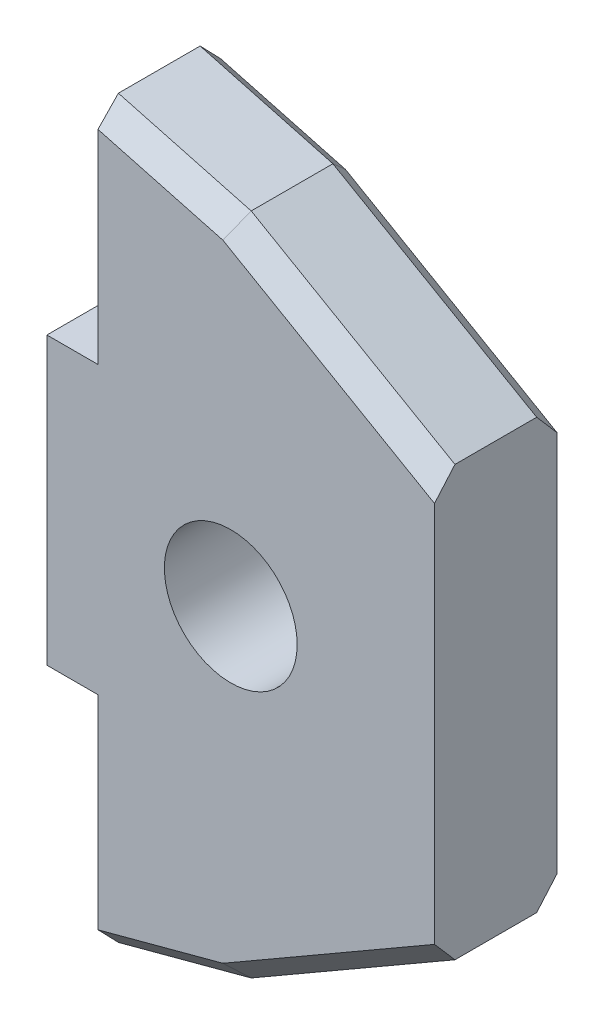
ISO-10303-21;
HEADER;
FILE_DESCRIPTION(('STEP AP214'),'2;1');
FILE_NAME('part.step','',(''),(''),'','','');
FILE_SCHEMA(('AUTOMOTIVE_DESIGN { 1 0 10303 214 1 1 1 1 }'));
ENDSEC;
DATA;
#1=APPLICATION_CONTEXT('core data for automotive mechanical design processes');
#2=APPLICATION_PROTOCOL_DEFINITION('international standard','automotive_design',2000,#1);
#3=PRODUCT_CONTEXT('',#1,'mechanical');
#4=PRODUCT('Part','Part','',(#3));
#5=PRODUCT_RELATED_PRODUCT_CATEGORY('part','',(#4));
#6=PRODUCT_DEFINITION_FORMATION('','',#4);
#7=PRODUCT_DEFINITION_CONTEXT('part definition',#1,'design');
#8=PRODUCT_DEFINITION('design','',#6,#7);
#9=PRODUCT_DEFINITION_SHAPE('','',#8);
#10=(LENGTH_UNIT() NAMED_UNIT(*) SI_UNIT(.MILLI.,.METRE.));
#11=(NAMED_UNIT(*) PLANE_ANGLE_UNIT() SI_UNIT($,.RADIAN.));
#12=(NAMED_UNIT(*) SI_UNIT($,.STERADIAN.) SOLID_ANGLE_UNIT());
#13=UNCERTAINTY_MEASURE_WITH_UNIT(LENGTH_MEASURE(1.E-05),#10,'distance_accuracy_value','');
#14=(GEOMETRIC_REPRESENTATION_CONTEXT(3) GLOBAL_UNCERTAINTY_ASSIGNED_CONTEXT((#13)) GLOBAL_UNIT_ASSIGNED_CONTEXT((#10,
#11,#12)) REPRESENTATION_CONTEXT('',''));
#15=CARTESIAN_POINT('',(0.,0.,0.));
#16=DIRECTION('',(0.,0.,1.));
#17=DIRECTION('',(1.,0.,0.));
#18=AXIS2_PLACEMENT_3D('',#15,#16,#17);
#19=CARTESIAN_POINT('',(0.,0.,12.));
#20=DIRECTION('',(0.,0.,-1.));
#21=DIRECTION('',(-1.,0.,0.));
#22=AXIS2_PLACEMENT_3D('',#19,#20,#21);
#23=PLANE('',#22);
#24=DIRECTION('',(0.,-1.,0.));
#25=VECTOR('',#24,1.);
#26=CARTESIAN_POINT('',(-13.,-14.,12.));
#27=LINE('',#26,#25);
#28=CARTESIAN_POINT('',(-13.,-14.,12.));
#29=VERTEX_POINT('',#28);
#30=CARTESIAN_POINT('',(-13.,-33.9294476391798,12.));
#31=VERTEX_POINT('',#30);
#32=EDGE_CURVE('E192',#29,#31,#27,.T.);
#33=ORIENTED_EDGE('',*,*,#32,.T.);
#34=DIRECTION('',(0.965925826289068,0.258819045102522,0.));
#35=VECTOR('',#34,1.);
#36=CARTESIAN_POINT('',(7.61152703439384,-28.4066056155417,12.));
#37=LINE('',#36,#35);
#38=CARTESIAN_POINT('',(-0.771971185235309,-30.6529571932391,12.));
#39=VERTEX_POINT('',#38);
#40=EDGE_CURVE('E262',#31,#39,#37,.T.);
#41=ORIENTED_EDGE('',*,*,#40,.T.);
#42=DIRECTION('',(0.866025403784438,0.5,0.));
#43=VECTOR('',#42,1.);
#44=CARTESIAN_POINT('',(13.0801270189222,-22.6554445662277,12.));
#45=LINE('',#44,#43);
#46=CARTESIAN_POINT('',(19.9474411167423,-18.6905989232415,12.));
#47=VERTEX_POINT('',#46);
#48=EDGE_CURVE('E265',#39,#47,#45,.T.);
#49=ORIENTED_EDGE('',*,*,#48,.T.);
#50=DIRECTION('',(0.,1.,0.));
#51=VECTOR('',#50,1.);
#52=CARTESIAN_POINT('',(19.9474411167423,21.,12.));
#53=LINE('',#52,#51);
#54=CARTESIAN_POINT('',(19.9474411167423,18.6905989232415,12.));
#55=VERTEX_POINT('',#54);
#56=EDGE_CURVE('E193',#47,#55,#53,.T.);
#57=ORIENTED_EDGE('',*,*,#56,.T.);
#58=DIRECTION('',(-0.866025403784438,0.5,0.));
#59=VECTOR('',#58,1.);
#60=CARTESIAN_POINT('',(13.0801270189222,22.6554445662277,12.));
#61=LINE('',#60,#59);
#62=CARTESIAN_POINT('',(-0.771971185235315,30.6529571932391,12.));
#63=VERTEX_POINT('',#62);
#64=EDGE_CURVE('E257',#55,#63,#61,.T.);
#65=ORIENTED_EDGE('',*,*,#64,.T.);
#66=DIRECTION('',(-0.965925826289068,0.258819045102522,0.));
#67=VECTOR('',#66,1.);
#68=CARTESIAN_POINT('',(7.61152703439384,28.4066056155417,12.));
#69=LINE('',#68,#67);
#70=CARTESIAN_POINT('',(-13.,33.9294476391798,12.));
#71=VERTEX_POINT('',#70);
#72=EDGE_CURVE('E164',#63,#71,#69,.T.);
#73=ORIENTED_EDGE('',*,*,#72,.T.);
#74=DIRECTION('',(0.,-1.,0.));
#75=VECTOR('',#74,1.);
#76=CARTESIAN_POINT('',(-13.,14.,12.));
#77=LINE('',#76,#75);
#78=CARTESIAN_POINT('',(-13.,14.,12.));
#79=VERTEX_POINT('',#78);
#80=EDGE_CURVE('E156',#71,#79,#77,.T.);
#81=ORIENTED_EDGE('',*,*,#80,.T.);
#82=DIRECTION('',(-1.,0.,0.));
#83=VECTOR('',#82,1.);
#84=CARTESIAN_POINT('',(-18.,14.,12.));
#85=LINE('',#84,#83);
#86=CARTESIAN_POINT('',(-18.,14.,12.));
#87=VERTEX_POINT('',#86);
#88=EDGE_CURVE('E161',#79,#87,#85,.T.);
#89=ORIENTED_EDGE('',*,*,#88,.T.);
#90=DIRECTION('',(0.,-1.,0.));
#91=VECTOR('',#90,1.);
#92=CARTESIAN_POINT('',(-18.,-14.,12.));
#93=LINE('',#92,#91);
#94=CARTESIAN_POINT('',(-18.,-14.,12.));
#95=VERTEX_POINT('',#94);
#96=EDGE_CURVE('E184',#87,#95,#93,.T.);
#97=ORIENTED_EDGE('',*,*,#96,.T.);
#98=DIRECTION('',(1.,0.,0.));
#99=VECTOR('',#98,1.);
#100=CARTESIAN_POINT('',(-18.,-14.,12.));
#101=LINE('',#100,#99);
#102=EDGE_CURVE('E187',#95,#29,#101,.T.);
#103=ORIENTED_EDGE('',*,*,#102,.T.);
#104=EDGE_LOOP('',(#33,#41,#49,#57,#65,#73,#81,#89,#97,#103));
#105=FACE_BOUND('',#104,.T.);
#106=CARTESIAN_POINT('',(0.,0.,12.));
#107=DIRECTION('',(0.,0.,1.));
#108=DIRECTION('',(1.,0.,0.));
#109=AXIS2_PLACEMENT_3D('',#106,#107,#108);
#110=CIRCLE('',#109,6.5);
#111=CARTESIAN_POINT('',(6.5,0.,12.));
#112=VERTEX_POINT('',#111);
#113=EDGE_CURVE('E200',#112,#112,#110,.T.);
#114=ORIENTED_EDGE('',*,*,#113,.F.);
#115=EDGE_LOOP('',(#114));
#116=FACE_BOUND('',#115,.T.);
#117=ADVANCED_FACE('F41',(#105,#116),#23,.F.);
#118=CARTESIAN_POINT('',(0.,0.,0.));
#119=DIRECTION('',(0.,0.,-1.));
#120=DIRECTION('',(-1.,0.,0.));
#121=AXIS2_PLACEMENT_3D('',#118,#119,#120);
#122=PLANE('',#121);
#123=DIRECTION('',(-0.866025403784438,-0.5,0.));
#124=VECTOR('',#123,1.);
#125=CARTESIAN_POINT('',(-1.00000000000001,-30.7846096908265,0.));
#126=LINE('',#125,#124);
#127=CARTESIAN_POINT('',(19.9474411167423,-18.6905989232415,0.));
#128=VERTEX_POINT('',#127);
#129=CARTESIAN_POINT('',(-0.771971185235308,-30.6529571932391,0.));
#130=VERTEX_POINT('',#129);
#131=EDGE_CURVE('E239',#128,#130,#126,.T.);
#132=ORIENTED_EDGE('',*,*,#131,.T.);
#133=DIRECTION('',(-0.965925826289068,-0.258819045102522,0.));
#134=VECTOR('',#133,1.);
#135=CARTESIAN_POINT('',(-13.517638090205,-34.0681483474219,0.));
#136=LINE('',#135,#134);
#137=CARTESIAN_POINT('',(-13.,-33.9294476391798,0.));
#138=VERTEX_POINT('',#137);
#139=EDGE_CURVE('E242',#130,#138,#136,.T.);
#140=ORIENTED_EDGE('',*,*,#139,.T.);
#141=DIRECTION('',(0.,-1.,0.));
#142=VECTOR('',#141,1.);
#143=CARTESIAN_POINT('',(-13.,-14.,0.));
#144=LINE('',#143,#142);
#145=CARTESIAN_POINT('',(-13.,-14.,0.));
#146=VERTEX_POINT('',#145);
#147=EDGE_CURVE('E202',#146,#138,#144,.T.);
#148=ORIENTED_EDGE('',*,*,#147,.F.);
#149=DIRECTION('',(1.,0.,0.));
#150=VECTOR('',#149,1.);
#151=CARTESIAN_POINT('',(-18.,-14.,0.));
#152=LINE('',#151,#150);
#153=CARTESIAN_POINT('',(-18.,-14.,0.));
#154=VERTEX_POINT('',#153);
#155=EDGE_CURVE('E201',#154,#146,#152,.T.);
#156=ORIENTED_EDGE('',*,*,#155,.F.);
#157=DIRECTION('',(0.,-1.,0.));
#158=VECTOR('',#157,1.);
#159=CARTESIAN_POINT('',(-18.,-14.,0.));
#160=LINE('',#159,#158);
#161=CARTESIAN_POINT('',(-18.,14.,0.));
#162=VERTEX_POINT('',#161);
#163=EDGE_CURVE('E203',#162,#154,#160,.T.);
#164=ORIENTED_EDGE('',*,*,#163,.F.);
#165=DIRECTION('',(-1.,0.,0.));
#166=VECTOR('',#165,1.);
#167=CARTESIAN_POINT('',(-18.,14.,0.));
#168=LINE('',#167,#166);
#169=CARTESIAN_POINT('',(-13.,14.,0.));
#170=VERTEX_POINT('',#169);
#171=EDGE_CURVE('E196',#170,#162,#168,.T.);
#172=ORIENTED_EDGE('',*,*,#171,.F.);
#173=DIRECTION('',(0.,-1.,0.));
#174=VECTOR('',#173,1.);
#175=CARTESIAN_POINT('',(-13.,14.,0.));
#176=LINE('',#175,#174);
#177=CARTESIAN_POINT('',(-13.,33.9294476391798,0.));
#178=VERTEX_POINT('',#177);
#179=EDGE_CURVE('E173',#178,#170,#176,.T.);
#180=ORIENTED_EDGE('',*,*,#179,.F.);
#181=DIRECTION('',(0.965925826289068,-0.258819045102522,0.));
#182=VECTOR('',#181,1.);
#183=CARTESIAN_POINT('',(-0.51763809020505,30.5848088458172,0.));
#184=LINE('',#183,#182);
#185=CARTESIAN_POINT('',(-0.7719711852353,30.6529571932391,0.));
#186=VERTEX_POINT('',#185);
#187=EDGE_CURVE('E240',#178,#186,#184,.T.);
#188=ORIENTED_EDGE('',*,*,#187,.T.);
#189=DIRECTION('',(0.866025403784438,-0.5,0.));
#190=VECTOR('',#189,1.);
#191=CARTESIAN_POINT('',(18.9474411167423,19.2679491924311,0.));
#192=LINE('',#191,#190);
#193=CARTESIAN_POINT('',(19.9474411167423,18.6905989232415,0.));
#194=VERTEX_POINT('',#193);
#195=EDGE_CURVE('E231',#186,#194,#192,.T.);
#196=ORIENTED_EDGE('',*,*,#195,.T.);
#197=DIRECTION('',(0.,1.,0.));
#198=VECTOR('',#197,1.);
#199=CARTESIAN_POINT('',(19.9474411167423,21.,0.));
#200=LINE('',#199,#198);
#201=EDGE_CURVE('E169',#128,#194,#200,.T.);
#202=ORIENTED_EDGE('',*,*,#201,.F.);
#203=EDGE_LOOP('',(#132,#140,#148,#156,#164,#172,#180,#188,#196,#202));
#204=FACE_BOUND('',#203,.T.);
#205=CARTESIAN_POINT('',(0.,0.,0.));
#206=DIRECTION('',(0.,0.,1.));
#207=DIRECTION('',(1.,0.,0.));
#208=AXIS2_PLACEMENT_3D('',#205,#206,#207);
#209=CIRCLE('',#208,6.5);
#210=CARTESIAN_POINT('',(6.5,0.,0.));
#211=VERTEX_POINT('',#210);
#212=EDGE_CURVE('E279',#211,#211,#209,.T.);
#213=ORIENTED_EDGE('',*,*,#212,.T.);
#214=EDGE_LOOP('',(#213));
#215=FACE_BOUND('',#214,.T.);
#216=ADVANCED_FACE('F327',(#204,#215),#122,.T.);
#217=CARTESIAN_POINT('',(0.,32.5166604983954,12.));
#218=DIRECTION('',(-0.5,-0.866025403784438,0.));
#219=DIRECTION('',(0.866025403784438,-0.5,0.));
#220=AXIS2_PLACEMENT_3D('',#217,#218,#219);
#221=PLANE('',#220);
#222=DIRECTION('',(0.,0.,-1.));
#223=VECTOR('',#222,1.);
#224=CARTESIAN_POINT('',(19.9474411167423,21.,12.));
#225=LINE('',#224,#223);
#226=CARTESIAN_POINT('',(19.9474411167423,21.,10.));
#227=VERTEX_POINT('',#226);
#228=CARTESIAN_POINT('',(19.9474411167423,21.,2.));
#229=VERTEX_POINT('',#228);
#230=EDGE_CURVE('E198',#227,#229,#225,.T.);
#231=ORIENTED_EDGE('',*,*,#230,.T.);
#232=DIRECTION('',(-0.866025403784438,0.5,0.));
#233=VECTOR('',#232,1.);
#234=CARTESIAN_POINT('',(0.,32.5166604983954,2.));
#235=LINE('',#234,#233);
#236=CARTESIAN_POINT('',(0.,32.5166604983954,2.));
#237=VERTEX_POINT('',#236);
#238=EDGE_CURVE('E11',#229,#237,#235,.T.);
#239=ORIENTED_EDGE('',*,*,#238,.T.);
#240=DIRECTION('',(0.,0.,-1.));
#241=VECTOR('',#240,1.);
#242=CARTESIAN_POINT('',(0.,32.5166604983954,12.));
#243=LINE('',#242,#241);
#244=CARTESIAN_POINT('',(0.,32.5166604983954,10.));
#245=VERTEX_POINT('',#244);
#246=EDGE_CURVE('E229',#245,#237,#243,.T.);
#247=ORIENTED_EDGE('',*,*,#246,.F.);
#248=DIRECTION('',(0.866025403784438,-0.5,0.));
#249=VECTOR('',#248,1.);
#250=CARTESIAN_POINT('',(0.,32.5166604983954,10.));
#251=LINE('',#250,#249);
#252=EDGE_CURVE('E51',#245,#227,#251,.T.);
#253=ORIENTED_EDGE('',*,*,#252,.T.);
#254=EDGE_LOOP('',(#231,#239,#247,#253));
#255=FACE_BOUND('',#254,.T.);
#256=ADVANCED_FACE('F341',(#255),#221,.F.);
#257=CARTESIAN_POINT('',(-13.,36.,12.));
#258=DIRECTION('',(-0.258819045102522,-0.965925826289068,0.));
#259=DIRECTION('',(0.965925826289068,-0.258819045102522,0.));
#260=AXIS2_PLACEMENT_3D('',#257,#258,#259);
#261=PLANE('',#260);
#262=ORIENTED_EDGE('',*,*,#246,.T.);
#263=DIRECTION('',(-0.965925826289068,0.258819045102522,0.));
#264=VECTOR('',#263,1.);
#265=CARTESIAN_POINT('',(-13.,36.,2.));
#266=LINE('',#265,#264);
#267=CARTESIAN_POINT('',(-13.,36.,2.));
#268=VERTEX_POINT('',#267);
#269=EDGE_CURVE('E268',#237,#268,#266,.T.);
#270=ORIENTED_EDGE('',*,*,#269,.T.);
#271=DIRECTION('',(0.,0.,-1.));
#272=VECTOR('',#271,1.);
#273=CARTESIAN_POINT('',(-13.,36.,12.));
#274=LINE('',#273,#272);
#275=CARTESIAN_POINT('',(-13.,36.,10.));
#276=VERTEX_POINT('',#275);
#277=EDGE_CURVE('E178',#276,#268,#274,.T.);
#278=ORIENTED_EDGE('',*,*,#277,.F.);
#279=DIRECTION('',(0.965925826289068,-0.258819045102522,0.));
#280=VECTOR('',#279,1.);
#281=CARTESIAN_POINT('',(-13.,36.,10.));
#282=LINE('',#281,#280);
#283=EDGE_CURVE('E61',#276,#245,#282,.T.);
#284=ORIENTED_EDGE('',*,*,#283,.T.);
#285=EDGE_LOOP('',(#262,#270,#278,#284));
#286=FACE_BOUND('',#285,.T.);
#287=ADVANCED_FACE('F347',(#286),#261,.F.);
#288=CARTESIAN_POINT('',(-13.,14.,12.));
#289=DIRECTION('',(1.,0.,0.));
#290=DIRECTION('',(0.,0.,-1.));
#291=AXIS2_PLACEMENT_3D('',#288,#289,#290);
#292=PLANE('',#291);
#293=ORIENTED_EDGE('',*,*,#277,.T.);
#294=DIRECTION('',(0.,-0.719254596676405,-0.694746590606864));
#295=VECTOR('',#294,1.);
#296=CARTESIAN_POINT('',(-13.,36.,2.));
#297=LINE('',#296,#295);
#298=EDGE_CURVE('E272',#268,#178,#297,.T.);
#299=ORIENTED_EDGE('',*,*,#298,.T.);
#300=ORIENTED_EDGE('',*,*,#179,.T.);
#301=DIRECTION('',(0.,0.,-1.));
#302=VECTOR('',#301,1.);
#303=CARTESIAN_POINT('',(-13.,14.,12.));
#304=LINE('',#303,#302);
#305=EDGE_CURVE('E172',#79,#170,#304,.T.);
#306=ORIENTED_EDGE('',*,*,#305,.F.);
#307=ORIENTED_EDGE('',*,*,#80,.F.);
#308=DIRECTION('',(0.,-0.719254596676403,0.694746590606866));
#309=VECTOR('',#308,1.);
#310=CARTESIAN_POINT('',(-13.,31.0723313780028,14.7597623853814));
#311=LINE('',#310,#309);
#312=EDGE_CURVE('E271',#71,#276,#311,.F.);
#313=ORIENTED_EDGE('',*,*,#312,.T.);
#314=EDGE_LOOP('',(#293,#299,#300,#306,#307,#313));
#315=FACE_BOUND('',#314,.T.);
#316=ADVANCED_FACE('F174',(#315),#292,.F.);
#317=CARTESIAN_POINT('',(-18.,14.,12.));
#318=DIRECTION('',(0.,-1.,0.));
#319=DIRECTION('',(0.,0.,-1.));
#320=AXIS2_PLACEMENT_3D('',#317,#318,#319);
#321=PLANE('',#320);
#322=ORIENTED_EDGE('',*,*,#171,.T.);
#323=DIRECTION('',(0.,0.,-1.));
#324=VECTOR('',#323,1.);
#325=CARTESIAN_POINT('',(-18.,14.,12.));
#326=LINE('',#325,#324);
#327=EDGE_CURVE('E179',#87,#162,#326,.T.);
#328=ORIENTED_EDGE('',*,*,#327,.F.);
#329=ORIENTED_EDGE('',*,*,#88,.F.);
#330=ORIENTED_EDGE('',*,*,#305,.T.);
#331=EDGE_LOOP('',(#322,#328,#329,#330));
#332=FACE_BOUND('',#331,.T.);
#333=ADVANCED_FACE('F182',(#332),#321,.F.);
#334=CARTESIAN_POINT('',(-18.,-14.,12.));
#335=DIRECTION('',(1.,0.,0.));
#336=DIRECTION('',(0.,0.,-1.));
#337=AXIS2_PLACEMENT_3D('',#334,#335,#336);
#338=PLANE('',#337);
#339=ORIENTED_EDGE('',*,*,#163,.T.);
#340=DIRECTION('',(0.,0.,-1.));
#341=VECTOR('',#340,1.);
#342=CARTESIAN_POINT('',(-18.,-14.,12.));
#343=LINE('',#342,#341);
#344=EDGE_CURVE('E224',#95,#154,#343,.T.);
#345=ORIENTED_EDGE('',*,*,#344,.F.);
#346=ORIENTED_EDGE('',*,*,#96,.F.);
#347=ORIENTED_EDGE('',*,*,#327,.T.);
#348=EDGE_LOOP('',(#339,#345,#346,#347));
#349=FACE_BOUND('',#348,.T.);
#350=ADVANCED_FACE('F380',(#349),#338,.F.);
#351=CARTESIAN_POINT('',(-18.,-14.,12.));
#352=DIRECTION('',(0.,1.,0.));
#353=DIRECTION('',(0.,0.,1.));
#354=AXIS2_PLACEMENT_3D('',#351,#352,#353);
#355=PLANE('',#354);
#356=ORIENTED_EDGE('',*,*,#155,.T.);
#357=DIRECTION('',(0.,0.,-1.));
#358=VECTOR('',#357,1.);
#359=CARTESIAN_POINT('',(-13.,-14.,12.));
#360=LINE('',#359,#358);
#361=EDGE_CURVE('E219',#29,#146,#360,.T.);
#362=ORIENTED_EDGE('',*,*,#361,.F.);
#363=ORIENTED_EDGE('',*,*,#102,.F.);
#364=ORIENTED_EDGE('',*,*,#344,.T.);
#365=EDGE_LOOP('',(#356,#362,#363,#364));
#366=FACE_BOUND('',#365,.T.);
#367=ADVANCED_FACE('F323',(#366),#355,.F.);
#368=CARTESIAN_POINT('',(-13.,-14.,12.));
#369=DIRECTION('',(1.,0.,0.));
#370=DIRECTION('',(0.,0.,-1.));
#371=AXIS2_PLACEMENT_3D('',#368,#369,#370);
#372=PLANE('',#371);
#373=ORIENTED_EDGE('',*,*,#147,.T.);
#374=DIRECTION('',(0.,-0.719254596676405,0.694746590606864));
#375=VECTOR('',#374,1.);
#376=CARTESIAN_POINT('',(-13.,-36.,2.));
#377=LINE('',#376,#375);
#378=CARTESIAN_POINT('',(-13.,-36.,2.));
#379=VERTEX_POINT('',#378);
#380=EDGE_CURVE('E243',#138,#379,#377,.T.);
#381=ORIENTED_EDGE('',*,*,#380,.T.);
#382=DIRECTION('',(0.,0.,-1.));
#383=VECTOR('',#382,1.);
#384=CARTESIAN_POINT('',(-13.,-36.,12.));
#385=LINE('',#384,#383);
#386=CARTESIAN_POINT('',(-13.,-36.,9.99999999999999));
#387=VERTEX_POINT('',#386);
#388=EDGE_CURVE('E220',#387,#379,#385,.T.);
#389=ORIENTED_EDGE('',*,*,#388,.F.);
#390=DIRECTION('',(0.,-0.719254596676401,-0.694746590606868));
#391=VECTOR('',#390,1.);
#392=CARTESIAN_POINT('',(-13.,-31.0723313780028,14.7597623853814));
#393=LINE('',#392,#391);
#394=EDGE_CURVE('E244',#387,#31,#393,.F.);
#395=ORIENTED_EDGE('',*,*,#394,.T.);
#396=ORIENTED_EDGE('',*,*,#32,.F.);
#397=ORIENTED_EDGE('',*,*,#361,.T.);
#398=EDGE_LOOP('',(#373,#381,#389,#395,#396,#397));
#399=FACE_BOUND('',#398,.T.);
#400=ADVANCED_FACE('F318',(#399),#372,.F.);
#401=CARTESIAN_POINT('',(-13.,-36.,12.));
#402=DIRECTION('',(-0.258819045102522,0.965925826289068,0.));
#403=DIRECTION('',(-0.965925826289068,-0.258819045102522,0.));
#404=AXIS2_PLACEMENT_3D('',#401,#402,#403);
#405=PLANE('',#404);
#406=ORIENTED_EDGE('',*,*,#388,.T.);
#407=DIRECTION('',(0.965925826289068,0.258819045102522,0.));
#408=VECTOR('',#407,1.);
#409=CARTESIAN_POINT('',(0.,-32.5166604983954,2.));
#410=LINE('',#409,#408);
#411=CARTESIAN_POINT('',(0.,-32.5166604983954,2.));
#412=VERTEX_POINT('',#411);
#413=EDGE_CURVE('E235',#379,#412,#410,.T.);
#414=ORIENTED_EDGE('',*,*,#413,.T.);
#415=DIRECTION('',(0.,0.,-1.));
#416=VECTOR('',#415,1.);
#417=CARTESIAN_POINT('',(0.,-32.5166604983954,12.));
#418=LINE('',#417,#416);
#419=CARTESIAN_POINT('',(0.,-32.5166604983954,9.99999999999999));
#420=VERTEX_POINT('',#419);
#421=EDGE_CURVE('E212',#420,#412,#418,.T.);
#422=ORIENTED_EDGE('',*,*,#421,.F.);
#423=DIRECTION('',(-0.965925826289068,-0.258819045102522,0.));
#424=VECTOR('',#423,1.);
#425=CARTESIAN_POINT('',(-13.,-36.,9.99999999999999));
#426=LINE('',#425,#424);
#427=EDGE_CURVE('E228',#420,#387,#426,.T.);
#428=ORIENTED_EDGE('',*,*,#427,.T.);
#429=EDGE_LOOP('',(#406,#414,#422,#428));
#430=FACE_BOUND('',#429,.T.);
#431=ADVANCED_FACE('F310',(#430),#405,.F.);
#432=CARTESIAN_POINT('',(0.,-32.5166604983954,12.));
#433=DIRECTION('',(-0.5,0.866025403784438,0.));
#434=DIRECTION('',(-0.866025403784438,-0.5,0.));
#435=AXIS2_PLACEMENT_3D('',#432,#433,#434);
#436=PLANE('',#435);
#437=ORIENTED_EDGE('',*,*,#421,.T.);
#438=DIRECTION('',(0.866025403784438,0.5,0.));
#439=VECTOR('',#438,1.);
#440=CARTESIAN_POINT('',(19.9474411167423,-21.,2.));
#441=LINE('',#440,#439);
#442=CARTESIAN_POINT('',(19.9474411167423,-21.,2.));
#443=VERTEX_POINT('',#442);
#444=EDGE_CURVE('E249',#412,#443,#441,.T.);
#445=ORIENTED_EDGE('',*,*,#444,.T.);
#446=DIRECTION('',(0.,0.,-1.));
#447=VECTOR('',#446,1.);
#448=CARTESIAN_POINT('',(19.9474411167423,-21.,12.));
#449=LINE('',#448,#447);
#450=CARTESIAN_POINT('',(19.9474411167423,-21.,9.99999999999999));
#451=VERTEX_POINT('',#450);
#452=EDGE_CURVE('E211',#451,#443,#449,.T.);
#453=ORIENTED_EDGE('',*,*,#452,.F.);
#454=DIRECTION('',(-0.866025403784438,-0.5,0.));
#455=VECTOR('',#454,1.);
#456=CARTESIAN_POINT('',(0.,-32.5166604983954,9.99999999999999));
#457=LINE('',#456,#455);
#458=EDGE_CURVE('E250',#451,#420,#457,.T.);
#459=ORIENTED_EDGE('',*,*,#458,.T.);
#460=EDGE_LOOP('',(#437,#445,#453,#459));
#461=FACE_BOUND('',#460,.T.);
#462=ADVANCED_FACE('F308',(#461),#436,.F.);
#463=CARTESIAN_POINT('',(19.9474411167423,21.,12.));
#464=DIRECTION('',(-1.,0.,0.));
#465=DIRECTION('',(0.,0.,1.));
#466=AXIS2_PLACEMENT_3D('',#463,#464,#465);
#467=PLANE('',#466);
#468=ORIENTED_EDGE('',*,*,#452,.T.);
#469=DIRECTION('',(0.,0.755928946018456,-0.654653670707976));
#470=VECTOR('',#469,1.);
#471=CARTESIAN_POINT('',(19.9474411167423,-27.580948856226,7.6992688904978));
#472=LINE('',#471,#470);
#473=EDGE_CURVE('E260',#443,#128,#472,.T.);
#474=ORIENTED_EDGE('',*,*,#473,.T.);
#475=ORIENTED_EDGE('',*,*,#201,.T.);
#476=DIRECTION('',(0.,0.755928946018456,0.654653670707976));
#477=VECTOR('',#476,1.);
#478=CARTESIAN_POINT('',(19.9474411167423,27.580948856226,7.6992688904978));
#479=LINE('',#478,#477);
#480=EDGE_CURVE('E251',#194,#229,#479,.T.);
#481=ORIENTED_EDGE('',*,*,#480,.T.);
#482=ORIENTED_EDGE('',*,*,#230,.F.);
#483=DIRECTION('',(0.,0.755928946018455,-0.654653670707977));
#484=VECTOR('',#483,1.);
#485=CARTESIAN_POINT('',(19.9474411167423,20.9562250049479,10.0379102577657));
#486=LINE('',#485,#484);
#487=EDGE_CURVE('E253',#227,#55,#486,.F.);
#488=ORIENTED_EDGE('',*,*,#487,.T.);
#489=ORIENTED_EDGE('',*,*,#56,.F.);
#490=DIRECTION('',(0.,0.755928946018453,0.654653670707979));
#491=VECTOR('',#490,1.);
#492=CARTESIAN_POINT('',(19.9474411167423,-20.9562250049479,10.0379102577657));
#493=LINE('',#492,#491);
#494=EDGE_CURVE('E254',#47,#451,#493,.F.);
#495=ORIENTED_EDGE('',*,*,#494,.T.);
#496=EDGE_LOOP('',(#468,#474,#475,#481,#482,#488,#489,#495));
#497=FACE_BOUND('',#496,.T.);
#498=ADVANCED_FACE('F300',(#497),#467,.F.);
#499=CARTESIAN_POINT('',(0.,0.,12.));
#500=DIRECTION('',(0.,0.,-1.));
#501=DIRECTION('',(-1.,0.,0.));
#502=AXIS2_PLACEMENT_3D('',#499,#500,#501);
#503=CYLINDRICAL_SURFACE('',#502,6.5);
#504=ORIENTED_EDGE('',*,*,#113,.T.);
#505=EDGE_LOOP('',(#504));
#506=FACE_BOUND('',#505,.T.);
#507=ORIENTED_EDGE('',*,*,#212,.F.);
#508=EDGE_LOOP('',(#507));
#509=FACE_BOUND('',#508,.T.);
#510=ADVANCED_FACE('F364',(#506,#509),#503,.F.);
#511=CARTESIAN_POINT('',(0.,-32.5166604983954,2.));
#512=DIRECTION('',(0.353553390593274,-0.612372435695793,-0.707106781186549));
#513=DIRECTION('',(-0.866025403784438,-0.5,0.));
#514=AXIS2_PLACEMENT_3D('',#511,#512,#513);
#515=PLANE('',#514);
#516=ORIENTED_EDGE('',*,*,#473,.F.);
#517=ORIENTED_EDGE('',*,*,#444,.F.);
#518=DIRECTION('',(-0.271758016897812,0.656081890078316,-0.704062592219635));
#519=VECTOR('',#518,1.);
#520=CARTESIAN_POINT('',(0.,-32.5166604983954,2.));
#521=LINE('',#520,#519);
#522=EDGE_CURVE('E277',#130,#412,#521,.F.);
#523=ORIENTED_EDGE('',*,*,#522,.F.);
#524=ORIENTED_EDGE('',*,*,#131,.F.);
#525=EDGE_LOOP('',(#516,#517,#523,#524));
#526=FACE_BOUND('',#525,.T.);
#527=ADVANCED_FACE('F338',(#526),#515,.T.);
#528=CARTESIAN_POINT('',(-13.,-36.,2.));
#529=DIRECTION('',(0.18301270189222,-0.683012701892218,-0.707106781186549));
#530=DIRECTION('',(-0.965925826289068,-0.258819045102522,0.));
#531=AXIS2_PLACEMENT_3D('',#528,#529,#530);
#532=PLANE('',#531);
#533=ORIENTED_EDGE('',*,*,#380,.F.);
#534=ORIENTED_EDGE('',*,*,#139,.F.);
#535=ORIENTED_EDGE('',*,*,#522,.T.);
#536=ORIENTED_EDGE('',*,*,#413,.F.);
#537=EDGE_LOOP('',(#533,#534,#535,#536));
#538=FACE_BOUND('',#537,.T.);
#539=ADVANCED_FACE('F337',(#538),#532,.T.);
#540=CARTESIAN_POINT('',(13.0801270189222,-22.6554445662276,12.));
#541=DIRECTION('',(-0.353553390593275,0.612372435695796,-0.707106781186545));
#542=DIRECTION('',(0.866025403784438,0.5,0.));
#543=AXIS2_PLACEMENT_3D('',#540,#541,#542);
#544=PLANE('',#543);
#545=ORIENTED_EDGE('',*,*,#494,.F.);
#546=ORIENTED_EDGE('',*,*,#48,.F.);
#547=DIRECTION('',(0.271758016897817,-0.65608189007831,-0.704062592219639));
#548=VECTOR('',#547,1.);
#549=CARTESIAN_POINT('',(-1.1748808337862,-29.6802472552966,13.0438463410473));
#550=LINE('',#549,#548);
#551=EDGE_CURVE('E276',#420,#39,#550,.F.);
#552=ORIENTED_EDGE('',*,*,#551,.F.);
#553=ORIENTED_EDGE('',*,*,#458,.F.);
#554=EDGE_LOOP('',(#545,#546,#552,#553));
#555=FACE_BOUND('',#554,.T.);
#556=ADVANCED_FACE('F305',(#555),#544,.F.);
#557=CARTESIAN_POINT('',(7.61152703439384,-28.4066056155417,12.));
#558=DIRECTION('',(-0.183012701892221,0.683012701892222,-0.707106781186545));
#559=DIRECTION('',(0.965925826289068,0.258819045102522,0.));
#560=AXIS2_PLACEMENT_3D('',#557,#558,#559);
#561=PLANE('',#560);
#562=ORIENTED_EDGE('',*,*,#394,.F.);
#563=ORIENTED_EDGE('',*,*,#427,.F.);
#564=ORIENTED_EDGE('',*,*,#551,.T.);
#565=ORIENTED_EDGE('',*,*,#40,.F.);
#566=EDGE_LOOP('',(#562,#563,#564,#565));
#567=FACE_BOUND('',#566,.T.);
#568=ADVANCED_FACE('F314',(#567),#561,.F.);
#569=CARTESIAN_POINT('',(0.,32.5166604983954,2.));
#570=DIRECTION('',(0.353553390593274,0.612372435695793,-0.707106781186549));
#571=DIRECTION('',(0.866025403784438,-0.5,0.));
#572=AXIS2_PLACEMENT_3D('',#569,#570,#571);
#573=PLANE('',#572);
#574=ORIENTED_EDGE('',*,*,#480,.F.);
#575=ORIENTED_EDGE('',*,*,#195,.F.);
#576=DIRECTION('',(0.271758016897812,0.656081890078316,0.704062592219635));
#577=VECTOR('',#576,1.);
#578=CARTESIAN_POINT('',(0.,32.5166604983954,2.));
#579=LINE('',#578,#577);
#580=EDGE_CURVE('E278',#237,#186,#579,.F.);
#581=ORIENTED_EDGE('',*,*,#580,.F.);
#582=ORIENTED_EDGE('',*,*,#238,.F.);
#583=EDGE_LOOP('',(#574,#575,#581,#582));
#584=FACE_BOUND('',#583,.T.);
#585=ADVANCED_FACE('F344',(#584),#573,.T.);
#586=CARTESIAN_POINT('',(-13.,36.,2.));
#587=DIRECTION('',(0.18301270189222,0.683012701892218,-0.707106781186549));
#588=DIRECTION('',(0.965925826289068,-0.258819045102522,0.));
#589=AXIS2_PLACEMENT_3D('',#586,#587,#588);
#590=PLANE('',#589);
#591=ORIENTED_EDGE('',*,*,#580,.T.);
#592=ORIENTED_EDGE('',*,*,#187,.F.);
#593=ORIENTED_EDGE('',*,*,#298,.F.);
#594=ORIENTED_EDGE('',*,*,#269,.F.);
#595=EDGE_LOOP('',(#591,#592,#593,#594));
#596=FACE_BOUND('',#595,.T.);
#597=ADVANCED_FACE('F350',(#596),#590,.T.);
#598=CARTESIAN_POINT('',(7.61152703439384,28.4066056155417,12.));
#599=DIRECTION('',(-0.18301270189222,-0.68301270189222,-0.707106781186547));
#600=DIRECTION('',(-0.965925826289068,0.258819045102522,0.));
#601=AXIS2_PLACEMENT_3D('',#598,#599,#600);
#602=PLANE('',#601);
#603=ORIENTED_EDGE('',*,*,#312,.F.);
#604=ORIENTED_EDGE('',*,*,#72,.F.);
#605=DIRECTION('',(0.271758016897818,0.656081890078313,-0.704062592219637));
#606=VECTOR('',#605,1.);
#607=CARTESIAN_POINT('',(-0.553343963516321,31.180769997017,11.4335870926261));
#608=LINE('',#607,#606);
#609=EDGE_CURVE('E46',#245,#63,#608,.F.);
#610=ORIENTED_EDGE('',*,*,#609,.F.);
#611=ORIENTED_EDGE('',*,*,#283,.F.);
#612=EDGE_LOOP('',(#603,#604,#610,#611));
#613=FACE_BOUND('',#612,.T.);
#614=ADVANCED_FACE('F42',(#613),#602,.F.);
#615=CARTESIAN_POINT('',(13.0801270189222,22.6554445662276,12.));
#616=DIRECTION('',(-0.353553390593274,-0.612372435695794,-0.707106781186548));
#617=DIRECTION('',(-0.866025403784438,0.5,0.));
#618=AXIS2_PLACEMENT_3D('',#615,#616,#617);
#619=PLANE('',#618);
#620=ORIENTED_EDGE('',*,*,#487,.F.);
#621=ORIENTED_EDGE('',*,*,#252,.F.);
#622=ORIENTED_EDGE('',*,*,#609,.T.);
#623=ORIENTED_EDGE('',*,*,#64,.F.);
#624=EDGE_LOOP('',(#620,#621,#622,#623));
#625=FACE_BOUND('',#624,.T.);
#626=ADVANCED_FACE('F292',(#625),#619,.F.);
#627=CLOSED_SHELL('',(#117,#216,#256,#287,#316,#333,#350,#367,#400,#431,#462,#498,#510,#527,
#539,#556,#568,#585,#597,#614,#626));
#628=MANIFOLD_SOLID_BREP('B2',#627);
#629=ADVANCED_BREP_SHAPE_REPRESENTATION('',(#18,#628),#14);
#630=SHAPE_DEFINITION_REPRESENTATION(#9,#629);
ENDSEC;
END-ISO-10303-21;
